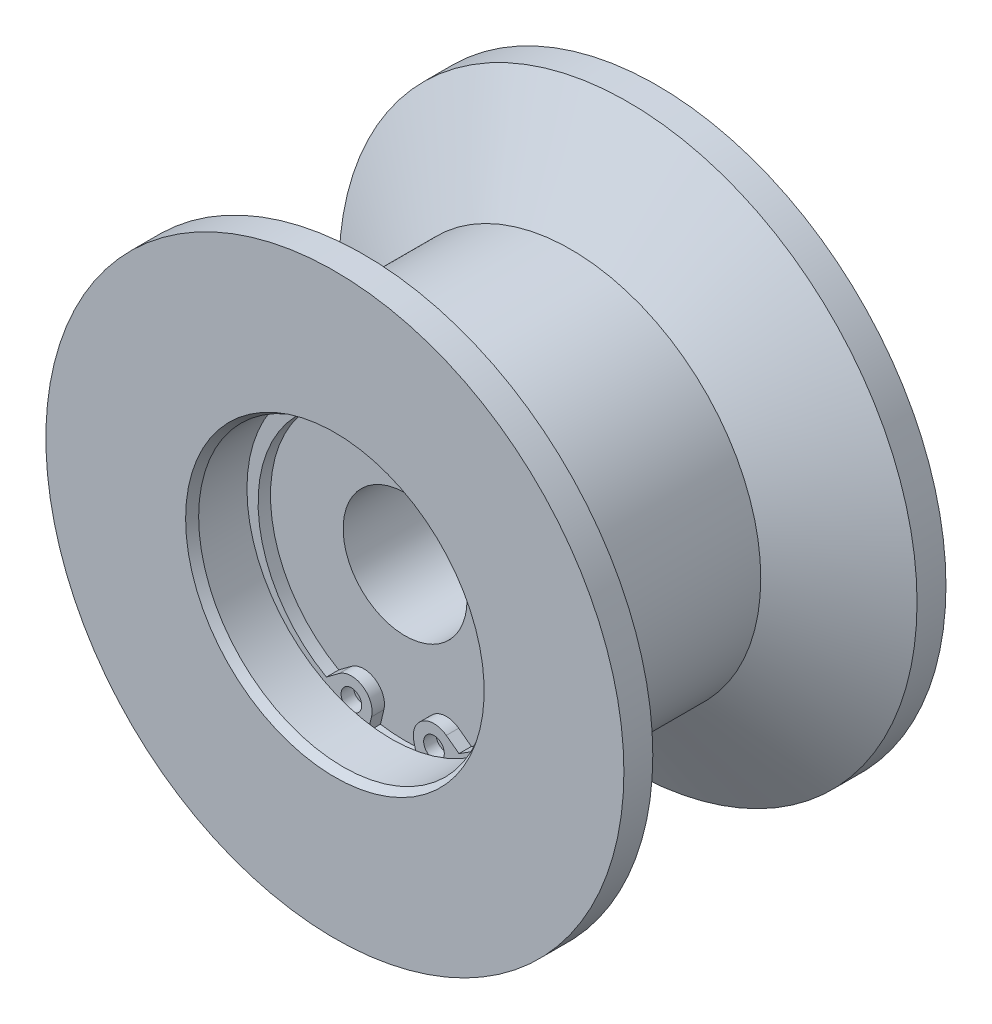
ISO-10303-21;
HEADER;
FILE_DESCRIPTION(('STEP AP214'),'2;1');
FILE_NAME('part.step','',(''),(''),'','','');
FILE_SCHEMA(('AUTOMOTIVE_DESIGN { 1 0 10303 214 1 1 1 1 }'));
ENDSEC;
DATA;
#1=APPLICATION_CONTEXT('core data for automotive mechanical design processes');
#2=APPLICATION_PROTOCOL_DEFINITION('international standard','automotive_design',2000,#1);
#3=PRODUCT_CONTEXT('',#1,'mechanical');
#4=PRODUCT('Part','Part','',(#3));
#5=PRODUCT_RELATED_PRODUCT_CATEGORY('part','',(#4));
#6=PRODUCT_DEFINITION_FORMATION('','',#4);
#7=PRODUCT_DEFINITION_CONTEXT('part definition',#1,'design');
#8=PRODUCT_DEFINITION('design','',#6,#7);
#9=PRODUCT_DEFINITION_SHAPE('','',#8);
#10=(LENGTH_UNIT() NAMED_UNIT(*) SI_UNIT(.MILLI.,.METRE.));
#11=(NAMED_UNIT(*) PLANE_ANGLE_UNIT() SI_UNIT($,.RADIAN.));
#12=(NAMED_UNIT(*) SI_UNIT($,.STERADIAN.) SOLID_ANGLE_UNIT());
#13=UNCERTAINTY_MEASURE_WITH_UNIT(LENGTH_MEASURE(1.E-05),#10,'distance_accuracy_value','');
#14=(GEOMETRIC_REPRESENTATION_CONTEXT(3) GLOBAL_UNCERTAINTY_ASSIGNED_CONTEXT((#13)) GLOBAL_UNIT_ASSIGNED_CONTEXT((#10,
#11,#12)) REPRESENTATION_CONTEXT('',''));
#15=CARTESIAN_POINT('',(0.,0.,0.));
#16=DIRECTION('',(0.,0.,1.));
#17=DIRECTION('',(1.,0.,0.));
#18=AXIS2_PLACEMENT_3D('',#15,#16,#17);
#19=CARTESIAN_POINT('',(6.49138441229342,-13.9421779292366,12.6));
#20=DIRECTION('',(-0.596553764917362,-0.802573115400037,0.));
#21=DIRECTION('',(-0.802573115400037,0.596553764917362,0.));
#22=AXIS2_PLACEMENT_3D('',#19,#20,#21);
#23=PLANE('',#22);
#24=DIRECTION('',(-0.802573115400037,0.596553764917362,0.));
#25=VECTOR('',#24,1.);
#26=CARTESIAN_POINT('',(6.49138441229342,-13.9421779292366,12.5));
#27=LINE('',#26,#25);
#28=CARTESIAN_POINT('',(8.02922574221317,-15.0852576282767,12.5));
#29=VERTEX_POINT('',#28);
#30=CARTESIAN_POINT('',(6.49138441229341,-13.9421779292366,12.5));
#31=VERTEX_POINT('',#30);
#32=EDGE_CURVE('E307',#29,#31,#27,.T.);
#33=ORIENTED_EDGE('',*,*,#32,.F.);
#34=DIRECTION('',(0.,0.,-1.));
#35=VECTOR('',#34,1.);
#36=CARTESIAN_POINT('',(8.02922574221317,-15.0852576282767,12.6));
#37=LINE('',#36,#35);
#38=CARTESIAN_POINT('',(8.02922574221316,-15.0852576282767,11.));
#39=VERTEX_POINT('',#38);
#40=EDGE_CURVE('E157',#29,#39,#37,.T.);
#41=ORIENTED_EDGE('',*,*,#40,.T.);
#42=DIRECTION('',(-0.802573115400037,0.596553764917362,0.));
#43=VECTOR('',#42,1.);
#44=CARTESIAN_POINT('',(-7.95591287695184,-3.20348082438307,11.));
#45=LINE('',#44,#43);
#46=CARTESIAN_POINT('',(6.49138441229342,-13.9421779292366,11.));
#47=VERTEX_POINT('',#46);
#48=EDGE_CURVE('E144',#39,#47,#45,.T.);
#49=ORIENTED_EDGE('',*,*,#48,.T.);
#50=DIRECTION('',(0.,0.,-1.));
#51=VECTOR('',#50,1.);
#52=CARTESIAN_POINT('',(6.49138441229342,-13.9421779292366,12.6));
#53=LINE('',#52,#51);
#54=EDGE_CURVE('E154',#31,#47,#53,.T.);
#55=ORIENTED_EDGE('',*,*,#54,.F.);
#56=EDGE_LOOP('',(#33,#41,#49,#55));
#57=FACE_BOUND('',#56,.T.);
#58=ADVANCED_FACE('F14',(#57),#23,.F.);
#59=CARTESIAN_POINT('',(0.,-0.9,12.6));
#60=DIRECTION('',(0.,0.,1.));
#61=DIRECTION('',(-1.,0.,0.));
#62=AXIS2_PLACEMENT_3D('',#59,#60,#61);
#63=CYLINDRICAL_SURFACE('',#62,16.3);
#64=CARTESIAN_POINT('',(0.,-0.9,12.5));
#65=DIRECTION('',(0.,0.,1.));
#66=DIRECTION('',(1.,0.,0.));
#67=AXIS2_PLACEMENT_3D('',#64,#65,#66);
#68=CIRCLE('',#67,16.3);
#69=CARTESIAN_POINT('',(-8.02922574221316,-15.0852576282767,12.5));
#70=VERTEX_POINT('',#69);
#71=EDGE_CURVE('E298',#70,#29,#68,.F.);
#72=ORIENTED_EDGE('',*,*,#71,.F.);
#73=DIRECTION('',(0.,0.,-1.));
#74=VECTOR('',#73,1.);
#75=CARTESIAN_POINT('',(-8.02922574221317,-15.0852576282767,12.6));
#76=LINE('',#75,#74);
#77=CARTESIAN_POINT('',(-8.02922574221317,-15.0852576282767,11.));
#78=VERTEX_POINT('',#77);
#79=EDGE_CURVE('E160',#70,#78,#76,.T.);
#80=ORIENTED_EDGE('',*,*,#79,.T.);
#81=CARTESIAN_POINT('',(0.,-0.9,11.));
#82=DIRECTION('',(0.,0.,-1.));
#83=DIRECTION('',(-1.,0.,0.));
#84=AXIS2_PLACEMENT_3D('',#81,#82,#83);
#85=CIRCLE('',#84,16.3);
#86=EDGE_CURVE('E140',#78,#39,#85,.T.);
#87=ORIENTED_EDGE('',*,*,#86,.T.);
#88=ORIENTED_EDGE('',*,*,#40,.F.);
#89=EDGE_LOOP('',(#72,#80,#87,#88));
#90=FACE_BOUND('',#89,.T.);
#91=ADVANCED_FACE('F239',(#90),#63,.F.);
#92=CARTESIAN_POINT('',(-6.49138441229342,-13.9421779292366,12.6));
#93=DIRECTION('',(0.596553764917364,-0.802573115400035,0.));
#94=DIRECTION('',(0.,0.,-1.));
#95=AXIS2_PLACEMENT_3D('',#92,#93,#94);
#96=PLANE('',#95);
#97=DIRECTION('',(-0.802573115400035,-0.596553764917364,0.));
#98=VECTOR('',#97,1.);
#99=CARTESIAN_POINT('',(-6.49138441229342,-13.9421779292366,12.5));
#100=LINE('',#99,#98);
#101=CARTESIAN_POINT('',(-6.49138441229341,-13.9421779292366,12.5));
#102=VERTEX_POINT('',#101);
#103=EDGE_CURVE('E301',#102,#70,#100,.T.);
#104=ORIENTED_EDGE('',*,*,#103,.F.);
#105=DIRECTION('',(0.,0.,-1.));
#106=VECTOR('',#105,1.);
#107=CARTESIAN_POINT('',(-6.49138441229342,-13.9421779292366,12.6));
#108=LINE('',#107,#106);
#109=CARTESIAN_POINT('',(-6.49138441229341,-13.9421779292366,11.));
#110=VERTEX_POINT('',#109);
#111=EDGE_CURVE('E163',#102,#110,#108,.T.);
#112=ORIENTED_EDGE('',*,*,#111,.T.);
#113=DIRECTION('',(-0.802573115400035,-0.596553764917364,0.));
#114=VECTOR('',#113,1.);
#115=CARTESIAN_POINT('',(7.95591287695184,-3.203480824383,11.));
#116=LINE('',#115,#114);
#117=EDGE_CURVE('E136',#110,#78,#116,.T.);
#118=ORIENTED_EDGE('',*,*,#117,.T.);
#119=ORIENTED_EDGE('',*,*,#79,.F.);
#120=EDGE_LOOP('',(#104,#112,#118,#119));
#121=FACE_BOUND('',#120,.T.);
#122=ADVANCED_FACE('F245',(#121),#96,.F.);
#123=CARTESIAN_POINT('',(5.,-15.9486107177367,12.6));
#124=DIRECTION('',(0.,0.,1.));
#125=DIRECTION('',(-1.,0.,0.));
#126=AXIS2_PLACEMENT_3D('',#123,#124,#125);
#127=CYLINDRICAL_SURFACE('',#126,2.5);
#128=DIRECTION('',(0.,0.,-1.));
#129=VECTOR('',#128,1.);
#130=CARTESIAN_POINT('',(2.5678231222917,-16.526983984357,12.6));
#131=LINE('',#130,#129);
#132=CARTESIAN_POINT('',(2.5678231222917,-16.526983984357,12.5));
#133=VERTEX_POINT('',#132);
#134=CARTESIAN_POINT('',(2.56782312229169,-16.526983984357,11.));
#135=VERTEX_POINT('',#134);
#136=EDGE_CURVE('E41',#133,#135,#131,.T.);
#137=ORIENTED_EDGE('',*,*,#136,.F.);
#138=CARTESIAN_POINT('',(5.,-15.9486107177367,12.5));
#139=DIRECTION('',(0.,0.,1.));
#140=DIRECTION('',(1.,0.,0.));
#141=AXIS2_PLACEMENT_3D('',#138,#139,#140);
#142=CIRCLE('',#141,2.5);
#143=EDGE_CURVE('E29',#133,#31,#142,.F.);
#144=ORIENTED_EDGE('',*,*,#143,.T.);
#145=ORIENTED_EDGE('',*,*,#54,.T.);
#146=CARTESIAN_POINT('',(5.,-15.9486107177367,11.));
#147=DIRECTION('',(0.,0.,-1.));
#148=DIRECTION('',(-1.,0.,0.));
#149=AXIS2_PLACEMENT_3D('',#146,#147,#148);
#150=CIRCLE('',#149,2.5);
#151=EDGE_CURVE('E148',#135,#47,#150,.T.);
#152=ORIENTED_EDGE('',*,*,#151,.F.);
#153=EDGE_LOOP('',(#137,#144,#145,#152));
#154=FACE_BOUND('',#153,.T.);
#155=ADVANCED_FACE('F291',(#154),#127,.T.);
#156=CARTESIAN_POINT('',(-5.,-15.9486107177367,12.6));
#157=DIRECTION('',(0.,0.,1.));
#158=DIRECTION('',(-1.,0.,0.));
#159=AXIS2_PLACEMENT_3D('',#156,#157,#158);
#160=CYLINDRICAL_SURFACE('',#159,2.5);
#161=ORIENTED_EDGE('',*,*,#111,.F.);
#162=CARTESIAN_POINT('',(-5.,-15.9486107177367,12.5));
#163=DIRECTION('',(0.,0.,1.));
#164=DIRECTION('',(1.,0.,0.));
#165=AXIS2_PLACEMENT_3D('',#162,#163,#164);
#166=CIRCLE('',#165,2.5);
#167=CARTESIAN_POINT('',(-2.5678231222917,-16.526983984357,12.5));
#168=VERTEX_POINT('',#167);
#169=EDGE_CURVE('E107',#102,#168,#166,.F.);
#170=ORIENTED_EDGE('',*,*,#169,.T.);
#171=DIRECTION('',(0.,0.,-1.));
#172=VECTOR('',#171,1.);
#173=CARTESIAN_POINT('',(-2.56782312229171,-16.526983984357,12.6));
#174=LINE('',#173,#172);
#175=CARTESIAN_POINT('',(-2.5678231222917,-16.526983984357,11.));
#176=VERTEX_POINT('',#175);
#177=EDGE_CURVE('E105',#168,#176,#174,.T.);
#178=ORIENTED_EDGE('',*,*,#177,.T.);
#179=CARTESIAN_POINT('',(-5.,-15.9486107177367,11.));
#180=DIRECTION('',(0.,0.,-1.));
#181=DIRECTION('',(-1.,0.,0.));
#182=AXIS2_PLACEMENT_3D('',#179,#180,#181);
#183=CIRCLE('',#182,2.5);
#184=EDGE_CURVE('E130',#110,#176,#183,.T.);
#185=ORIENTED_EDGE('',*,*,#184,.F.);
#186=EDGE_LOOP('',(#161,#170,#178,#185));
#187=FACE_BOUND('',#186,.T.);
#188=ADVANCED_FACE('F16',(#187),#160,.T.);
#189=CARTESIAN_POINT('',(-2.56782312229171,-16.526983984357,12.6));
#190=DIRECTION('',(-0.97287075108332,0.231349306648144,0.));
#191=DIRECTION('',(0.,0.,1.));
#192=AXIS2_PLACEMENT_3D('',#189,#190,#191);
#193=PLANE('',#192);
#194=DIRECTION('',(0.231349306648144,0.97287075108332,0.));
#195=VECTOR('',#194,1.);
#196=CARTESIAN_POINT('',(-2.56782312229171,-16.526983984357,12.5));
#197=LINE('',#196,#195);
#198=CARTESIAN_POINT('',(-2.97957431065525,-18.2584812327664,12.5));
#199=VERTEX_POINT('',#198);
#200=EDGE_CURVE('E92',#199,#168,#197,.T.);
#201=ORIENTED_EDGE('',*,*,#200,.F.);
#202=DIRECTION('',(0.,0.,-1.));
#203=VECTOR('',#202,1.);
#204=CARTESIAN_POINT('',(-2.97957431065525,-18.2584812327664,12.65));
#205=LINE('',#204,#203);
#206=CARTESIAN_POINT('',(-2.97957431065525,-18.2584812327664,11.));
#207=VERTEX_POINT('',#206);
#208=EDGE_CURVE('E103',#207,#199,#205,.F.);
#209=ORIENTED_EDGE('',*,*,#208,.F.);
#210=DIRECTION('',(0.231349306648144,0.97287075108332,0.));
#211=VECTOR('',#210,1.);
#212=CARTESIAN_POINT('',(2.97743793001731,6.79196329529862,11.));
#213=LINE('',#212,#211);
#214=EDGE_CURVE('E134',#207,#176,#213,.T.);
#215=ORIENTED_EDGE('',*,*,#214,.T.);
#216=ORIENTED_EDGE('',*,*,#177,.F.);
#217=EDGE_LOOP('',(#201,#209,#215,#216));
#218=FACE_BOUND('',#217,.T.);
#219=ADVANCED_FACE('F101',(#218),#193,.F.);
#220=CARTESIAN_POINT('',(2.5678231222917,-16.526983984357,12.6));
#221=DIRECTION('',(0.972870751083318,0.231349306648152,0.));
#222=DIRECTION('',(0.,0.,-1.));
#223=AXIS2_PLACEMENT_3D('',#220,#221,#222);
#224=PLANE('',#223);
#225=DIRECTION('',(0.231349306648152,-0.972870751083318,0.));
#226=VECTOR('',#225,1.);
#227=CARTESIAN_POINT('',(2.5678231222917,-16.526983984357,12.5));
#228=LINE('',#227,#226);
#229=CARTESIAN_POINT('',(2.97957431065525,-18.2584812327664,12.5));
#230=VERTEX_POINT('',#229);
#231=EDGE_CURVE('E22',#133,#230,#228,.T.);
#232=ORIENTED_EDGE('',*,*,#231,.F.);
#233=ORIENTED_EDGE('',*,*,#136,.T.);
#234=DIRECTION('',(0.231349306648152,-0.972870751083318,0.));
#235=VECTOR('',#234,1.);
#236=CARTESIAN_POINT('',(-2.97743793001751,6.79196329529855,11.));
#237=LINE('',#236,#235);
#238=CARTESIAN_POINT('',(2.97957431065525,-18.2584812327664,11.));
#239=VERTEX_POINT('',#238);
#240=EDGE_CURVE('E152',#135,#239,#237,.T.);
#241=ORIENTED_EDGE('',*,*,#240,.T.);
#242=DIRECTION('',(0.,0.,-1.));
#243=VECTOR('',#242,1.);
#244=CARTESIAN_POINT('',(2.97957431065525,-18.2584812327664,12.65));
#245=LINE('',#244,#243);
#246=EDGE_CURVE('E113',#230,#239,#245,.T.);
#247=ORIENTED_EDGE('',*,*,#246,.F.);
#248=EDGE_LOOP('',(#232,#233,#241,#247));
#249=FACE_BOUND('',#248,.T.);
#250=ADVANCED_FACE('F315',(#249),#224,.F.);
#251=CARTESIAN_POINT('',(0.,0.,24.5));
#252=DIRECTION('',(0.,0.,1.));
#253=DIRECTION('',(1.,0.,0.));
#254=AXIS2_PLACEMENT_3D('',#251,#252,#253);
#255=CYLINDRICAL_SURFACE('',#254,17.5);
#256=CARTESIAN_POINT('',(0.,0.,18.5));
#257=DIRECTION('',(0.,0.,-1.));
#258=DIRECTION('',(-1.,0.,0.));
#259=AXIS2_PLACEMENT_3D('',#256,#257,#258);
#260=CIRCLE('',#259,17.5);
#261=CARTESIAN_POINT('',(-17.5,0.,18.5));
#262=VERTEX_POINT('',#261);
#263=EDGE_CURVE('E119',#262,#262,#260,.F.);
#264=ORIENTED_EDGE('',*,*,#263,.T.);
#265=EDGE_LOOP('',(#264));
#266=FACE_BOUND('',#265,.T.);
#267=CARTESIAN_POINT('',(0.,0.,12.65));
#268=DIRECTION('',(0.,0.,-1.));
#269=DIRECTION('',(-1.,0.,0.));
#270=AXIS2_PLACEMENT_3D('',#267,#268,#269);
#271=CIRCLE('',#270,17.5);
#272=CARTESIAN_POINT('',(-17.5,0.,12.65));
#273=VERTEX_POINT('',#272);
#274=EDGE_CURVE('E97',#273,#273,#271,.T.);
#275=ORIENTED_EDGE('',*,*,#274,.T.);
#276=EDGE_LOOP('',(#275));
#277=FACE_BOUND('',#276,.T.);
#278=ADVANCED_FACE('F215',(#266,#277),#255,.F.);
#279=CARTESIAN_POINT('',(0.,0.,24.5));
#280=DIRECTION('',(0.,0.,1.));
#281=DIRECTION('',(1.,0.,0.));
#282=AXIS2_PLACEMENT_3D('',#279,#280,#281);
#283=CYLINDRICAL_SURFACE('',#282,22.9999999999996);
#284=CARTESIAN_POINT('',(0.,0.,9.0717967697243));
#285=DIRECTION('',(0.,0.,1.));
#286=DIRECTION('',(1.,0.,0.));
#287=AXIS2_PLACEMENT_3D('',#284,#285,#286);
#288=CIRCLE('',#287,22.9999999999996);
#289=CARTESIAN_POINT('',(22.9999999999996,0.,9.0717967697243));
#290=VERTEX_POINT('',#289);
#291=EDGE_CURVE('E186',#290,#290,#288,.T.);
#292=ORIENTED_EDGE('',*,*,#291,.F.);
#293=EDGE_LOOP('',(#292));
#294=FACE_BOUND('',#293,.T.);
#295=CARTESIAN_POINT('',(0.,0.,-9.07179676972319));
#296=DIRECTION('',(0.,0.,1.));
#297=DIRECTION('',(1.,0.,0.));
#298=AXIS2_PLACEMENT_3D('',#295,#296,#297);
#299=CIRCLE('',#298,22.9999999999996);
#300=CARTESIAN_POINT('',(22.9999999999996,0.,-9.07179676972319));
#301=VERTEX_POINT('',#300);
#302=EDGE_CURVE('E189',#301,#301,#299,.T.);
#303=ORIENTED_EDGE('',*,*,#302,.T.);
#304=EDGE_LOOP('',(#303));
#305=FACE_BOUND('',#304,.T.);
#306=ADVANCED_FACE('F314',(#294,#305),#283,.T.);
#307=CARTESIAN_POINT('',(0.,0.,-15.9999999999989));
#308=DIRECTION('',(0.,0.,-1.));
#309=DIRECTION('',(-1.,0.,0.));
#310=AXIS2_PLACEMENT_3D('',#307,#308,#309);
#311=CONICAL_SURFACE('',#310,35.,1.0471975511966);
#312=ORIENTED_EDGE('',*,*,#302,.F.);
#313=EDGE_LOOP('',(#312));
#314=FACE_BOUND('',#313,.T.);
#315=CARTESIAN_POINT('',(0.,0.,-15.9999999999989));
#316=DIRECTION('',(0.,0.,1.));
#317=DIRECTION('',(1.,0.,0.));
#318=AXIS2_PLACEMENT_3D('',#315,#316,#317);
#319=CIRCLE('',#318,35.);
#320=CARTESIAN_POINT('',(35.,0.,-15.9999999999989));
#321=VERTEX_POINT('',#320);
#322=EDGE_CURVE('E192',#321,#321,#319,.T.);
#323=ORIENTED_EDGE('',*,*,#322,.T.);
#324=EDGE_LOOP('',(#323));
#325=FACE_BOUND('',#324,.T.);
#326=ADVANCED_FACE('F320',(#314,#325),#311,.T.);
#327=CARTESIAN_POINT('',(0.,0.,9.0717967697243));
#328=DIRECTION('',(0.,0.,1.));
#329=DIRECTION('',(1.,0.,0.));
#330=AXIS2_PLACEMENT_3D('',#327,#328,#329);
#331=CONICAL_SURFACE('',#330,22.9999999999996,1.0471975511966);
#332=CARTESIAN_POINT('',(0.,0.,16.));
#333=DIRECTION('',(0.,0.,1.));
#334=DIRECTION('',(1.,0.,0.));
#335=AXIS2_PLACEMENT_3D('',#332,#333,#334);
#336=CIRCLE('',#335,35.);
#337=CARTESIAN_POINT('',(35.,0.,16.));
#338=VERTEX_POINT('',#337);
#339=EDGE_CURVE('E183',#338,#338,#336,.T.);
#340=ORIENTED_EDGE('',*,*,#339,.F.);
#341=EDGE_LOOP('',(#340));
#342=FACE_BOUND('',#341,.T.);
#343=ORIENTED_EDGE('',*,*,#291,.T.);
#344=EDGE_LOOP('',(#343));
#345=FACE_BOUND('',#344,.T.);
#346=ADVANCED_FACE('F338',(#342,#345),#331,.T.);
#347=CARTESIAN_POINT('',(0.,0.,24.5));
#348=DIRECTION('',(0.,0.,1.));
#349=DIRECTION('',(1.,0.,0.));
#350=AXIS2_PLACEMENT_3D('',#347,#348,#349);
#351=CYLINDRICAL_SURFACE('',#350,35.);
#352=ORIENTED_EDGE('',*,*,#322,.F.);
#353=EDGE_LOOP('',(#352));
#354=FACE_BOUND('',#353,.T.);
#355=CARTESIAN_POINT('',(0.,0.,-19.5000000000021));
#356=DIRECTION('',(0.,0.,1.));
#357=DIRECTION('',(1.,0.,0.));
#358=AXIS2_PLACEMENT_3D('',#355,#356,#357);
#359=CIRCLE('',#358,35.);
#360=CARTESIAN_POINT('',(35.,0.,-19.5000000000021));
#361=VERTEX_POINT('',#360);
#362=EDGE_CURVE('E195',#361,#361,#359,.T.);
#363=ORIENTED_EDGE('',*,*,#362,.T.);
#364=EDGE_LOOP('',(#363));
#365=FACE_BOUND('',#364,.T.);
#366=ADVANCED_FACE('F330',(#354,#365),#351,.T.);
#367=CARTESIAN_POINT('',(0.,0.,24.5));
#368=DIRECTION('',(0.,0.,1.));
#369=DIRECTION('',(1.,0.,0.));
#370=AXIS2_PLACEMENT_3D('',#367,#368,#369);
#371=CYLINDRICAL_SURFACE('',#370,35.);
#372=CARTESIAN_POINT('',(0.,0.,19.5));
#373=DIRECTION('',(0.,0.,1.));
#374=DIRECTION('',(1.,0.,0.));
#375=AXIS2_PLACEMENT_3D('',#372,#373,#374);
#376=CIRCLE('',#375,35.);
#377=CARTESIAN_POINT('',(35.,0.,19.5));
#378=VERTEX_POINT('',#377);
#379=EDGE_CURVE('E210',#378,#378,#376,.T.);
#380=ORIENTED_EDGE('',*,*,#379,.F.);
#381=EDGE_LOOP('',(#380));
#382=FACE_BOUND('',#381,.T.);
#383=ORIENTED_EDGE('',*,*,#339,.T.);
#384=EDGE_LOOP('',(#383));
#385=FACE_BOUND('',#384,.T.);
#386=ADVANCED_FACE('F328',(#382,#385),#371,.T.);
#387=CARTESIAN_POINT('',(0.,14.5,-19.5000000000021));
#388=DIRECTION('',(0.,0.,1.));
#389=DIRECTION('',(1.,0.,0.));
#390=AXIS2_PLACEMENT_3D('',#387,#388,#389);
#391=PLANE('',#390);
#392=ORIENTED_EDGE('',*,*,#362,.F.);
#393=EDGE_LOOP('',(#392));
#394=FACE_BOUND('',#393,.T.);
#395=CARTESIAN_POINT('',(0.,0.,-19.5000000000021));
#396=DIRECTION('',(0.,0.,1.));
#397=DIRECTION('',(1.,0.,0.));
#398=AXIS2_PLACEMENT_3D('',#395,#396,#397);
#399=CIRCLE('',#398,14.5);
#400=CARTESIAN_POINT('',(14.5,0.,-19.5000000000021));
#401=VERTEX_POINT('',#400);
#402=EDGE_CURVE('E198',#401,#401,#399,.T.);
#403=ORIENTED_EDGE('',*,*,#402,.T.);
#404=EDGE_LOOP('',(#403));
#405=FACE_BOUND('',#404,.T.);
#406=ADVANCED_FACE('F326',(#394,#405),#391,.F.);
#407=CARTESIAN_POINT('',(0.,17.5,19.5));
#408=DIRECTION('',(0.,0.,-1.));
#409=DIRECTION('',(-1.,0.,0.));
#410=AXIS2_PLACEMENT_3D('',#407,#408,#409);
#411=PLANE('',#410);
#412=CARTESIAN_POINT('',(0.,0.,19.5));
#413=DIRECTION('',(0.,0.,-1.));
#414=DIRECTION('',(-1.,0.,0.));
#415=AXIS2_PLACEMENT_3D('',#412,#413,#414);
#416=CIRCLE('',#415,18.0773502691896);
#417=CARTESIAN_POINT('',(-18.0773502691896,0.,19.5));
#418=VERTEX_POINT('',#417);
#419=EDGE_CURVE('E114',#418,#418,#416,.T.);
#420=ORIENTED_EDGE('',*,*,#419,.T.);
#421=EDGE_LOOP('',(#420));
#422=FACE_BOUND('',#421,.T.);
#423=ORIENTED_EDGE('',*,*,#379,.T.);
#424=EDGE_LOOP('',(#423));
#425=FACE_BOUND('',#424,.T.);
#426=ADVANCED_FACE('F232',(#422,#425),#411,.F.);
#427=CARTESIAN_POINT('',(0.,0.,24.5));
#428=DIRECTION('',(0.,0.,1.));
#429=DIRECTION('',(1.,0.,0.));
#430=AXIS2_PLACEMENT_3D('',#427,#428,#429);
#431=CYLINDRICAL_SURFACE('',#430,14.5);
#432=ORIENTED_EDGE('',*,*,#402,.F.);
#433=EDGE_LOOP('',(#432));
#434=FACE_BOUND('',#433,.T.);
#435=CARTESIAN_POINT('',(0.,0.,-11.0000000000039));
#436=DIRECTION('',(0.,0.,1.));
#437=DIRECTION('',(1.,0.,0.));
#438=AXIS2_PLACEMENT_3D('',#435,#436,#437);
#439=CIRCLE('',#438,14.5);
#440=CARTESIAN_POINT('',(14.5,0.,-11.0000000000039));
#441=VERTEX_POINT('',#440);
#442=EDGE_CURVE('E201',#441,#441,#439,.T.);
#443=ORIENTED_EDGE('',*,*,#442,.T.);
#444=EDGE_LOOP('',(#443));
#445=FACE_BOUND('',#444,.T.);
#446=ADVANCED_FACE('F221',(#434,#445),#431,.F.);
#447=CARTESIAN_POINT('',(0.,0.,18.5));
#448=DIRECTION('',(0.,0.,1.));
#449=DIRECTION('',(1.,0.,0.));
#450=AXIS2_PLACEMENT_3D('',#447,#448,#449);
#451=CONICAL_SURFACE('',#450,17.5,0.523598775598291);
#452=ORIENTED_EDGE('',*,*,#419,.F.);
#453=EDGE_LOOP('',(#452));
#454=FACE_BOUND('',#453,.T.);
#455=ORIENTED_EDGE('',*,*,#263,.F.);
#456=EDGE_LOOP('',(#455));
#457=FACE_BOUND('',#456,.T.);
#458=ADVANCED_FACE('F218',(#454,#457),#451,.F.);
#459=CARTESIAN_POINT('',(0.,7.5,-11.0000000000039));
#460=DIRECTION('',(0.,0.,1.));
#461=DIRECTION('',(1.,0.,0.));
#462=AXIS2_PLACEMENT_3D('',#459,#460,#461);
#463=PLANE('',#462);
#464=ORIENTED_EDGE('',*,*,#442,.F.);
#465=EDGE_LOOP('',(#464));
#466=FACE_BOUND('',#465,.T.);
#467=CARTESIAN_POINT('',(0.,0.,-11.0000000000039));
#468=DIRECTION('',(0.,0.,1.));
#469=DIRECTION('',(1.,0.,0.));
#470=AXIS2_PLACEMENT_3D('',#467,#468,#469);
#471=CIRCLE('',#470,7.5);
#472=CARTESIAN_POINT('',(7.5,0.,-11.0000000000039));
#473=VERTEX_POINT('',#472);
#474=EDGE_CURVE('E204',#473,#473,#471,.T.);
#475=ORIENTED_EDGE('',*,*,#474,.T.);
#476=EDGE_LOOP('',(#475));
#477=FACE_BOUND('',#476,.T.);
#478=ADVANCED_FACE('F220',(#466,#477),#463,.F.);
#479=CARTESIAN_POINT('',(0.,0.,24.5));
#480=DIRECTION('',(0.,0.,1.));
#481=DIRECTION('',(1.,0.,0.));
#482=AXIS2_PLACEMENT_3D('',#479,#480,#481);
#483=CYLINDRICAL_SURFACE('',#482,7.5);
#484=ORIENTED_EDGE('',*,*,#474,.F.);
#485=EDGE_LOOP('',(#484));
#486=FACE_BOUND('',#485,.T.);
#487=CARTESIAN_POINT('',(0.,0.,11.));
#488=DIRECTION('',(0.,0.,1.));
#489=DIRECTION('',(1.,0.,0.));
#490=AXIS2_PLACEMENT_3D('',#487,#488,#489);
#491=CIRCLE('',#490,7.5);
#492=CARTESIAN_POINT('',(7.5,0.,11.));
#493=VERTEX_POINT('',#492);
#494=EDGE_CURVE('E207',#493,#493,#491,.T.);
#495=ORIENTED_EDGE('',*,*,#494,.T.);
#496=EDGE_LOOP('',(#495));
#497=FACE_BOUND('',#496,.T.);
#498=ADVANCED_FACE('F229',(#486,#497),#483,.F.);
#499=CARTESIAN_POINT('',(0.,7.5,11.));
#500=DIRECTION('',(0.,0.,-1.));
#501=DIRECTION('',(-1.,0.,0.));
#502=AXIS2_PLACEMENT_3D('',#499,#500,#501);
#503=PLANE('',#502);
#504=ORIENTED_EDGE('',*,*,#494,.F.);
#505=EDGE_LOOP('',(#504));
#506=FACE_BOUND('',#505,.T.);
#507=ORIENTED_EDGE('',*,*,#240,.F.);
#508=ORIENTED_EDGE('',*,*,#151,.T.);
#509=ORIENTED_EDGE('',*,*,#48,.F.);
#510=ORIENTED_EDGE('',*,*,#86,.F.);
#511=ORIENTED_EDGE('',*,*,#117,.F.);
#512=ORIENTED_EDGE('',*,*,#184,.T.);
#513=ORIENTED_EDGE('',*,*,#214,.F.);
#514=CARTESIAN_POINT('',(0.,0.,11.));
#515=DIRECTION('',(0.,0.,1.));
#516=DIRECTION('',(1.,0.,0.));
#517=AXIS2_PLACEMENT_3D('',#514,#515,#516);
#518=CIRCLE('',#517,18.5);
#519=EDGE_CURVE('E112',#207,#239,#518,.T.);
#520=ORIENTED_EDGE('',*,*,#519,.T.);
#521=EDGE_LOOP('',(#507,#508,#509,#510,#511,#512,#513,#520));
#522=FACE_BOUND('',#521,.T.);
#523=ADVANCED_FACE('F266',(#506,#522),#503,.F.);
#524=CARTESIAN_POINT('',(0.,0.,12.65));
#525=DIRECTION('',(0.,0.,-1.));
#526=DIRECTION('',(-1.,0.,0.));
#527=AXIS2_PLACEMENT_3D('',#524,#525,#526);
#528=CYLINDRICAL_SURFACE('',#527,18.5);
#529=CARTESIAN_POINT('',(0.,0.,12.65));
#530=DIRECTION('',(0.,0.,-1.));
#531=DIRECTION('',(-1.,0.,0.));
#532=AXIS2_PLACEMENT_3D('',#529,#530,#531);
#533=CIRCLE('',#532,18.5);
#534=CARTESIAN_POINT('',(-18.5,0.,12.65));
#535=VERTEX_POINT('',#534);
#536=EDGE_CURVE('E9',#535,#535,#533,.T.);
#537=ORIENTED_EDGE('',*,*,#536,.F.);
#538=EDGE_LOOP('',(#537));
#539=FACE_BOUND('',#538,.T.);
#540=CARTESIAN_POINT('',(0.,0.,12.5));
#541=DIRECTION('',(0.,0.,1.));
#542=DIRECTION('',(1.,0.,0.));
#543=AXIS2_PLACEMENT_3D('',#540,#541,#542);
#544=CIRCLE('',#543,18.5);
#545=EDGE_CURVE('E88',#230,#199,#544,.T.);
#546=ORIENTED_EDGE('',*,*,#545,.F.);
#547=ORIENTED_EDGE('',*,*,#246,.T.);
#548=ORIENTED_EDGE('',*,*,#519,.F.);
#549=ORIENTED_EDGE('',*,*,#208,.T.);
#550=EDGE_LOOP('',(#546,#547,#548,#549));
#551=FACE_BOUND('',#550,.T.);
#552=ADVANCED_FACE('F110',(#539,#551),#528,.F.);
#553=CARTESIAN_POINT('',(0.,0.,12.5));
#554=DIRECTION('',(0.,0.,1.));
#555=DIRECTION('',(1.,0.,0.));
#556=AXIS2_PLACEMENT_3D('',#553,#554,#555);
#557=PLANE('',#556);
#558=ORIENTED_EDGE('',*,*,#200,.T.);
#559=ORIENTED_EDGE('',*,*,#169,.F.);
#560=ORIENTED_EDGE('',*,*,#103,.T.);
#561=ORIENTED_EDGE('',*,*,#71,.T.);
#562=ORIENTED_EDGE('',*,*,#32,.T.);
#563=ORIENTED_EDGE('',*,*,#143,.F.);
#564=ORIENTED_EDGE('',*,*,#231,.T.);
#565=ORIENTED_EDGE('',*,*,#545,.T.);
#566=EDGE_LOOP('',(#558,#559,#560,#561,#562,#563,#564,#565));
#567=FACE_BOUND('',#566,.T.);
#568=CARTESIAN_POINT('',(5.,-15.9486107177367,12.5));
#569=DIRECTION('',(0.,0.,1.));
#570=DIRECTION('',(1.,0.,0.));
#571=AXIS2_PLACEMENT_3D('',#568,#569,#570);
#572=CIRCLE('',#571,1.25);
#573=CARTESIAN_POINT('',(6.25,-15.9486107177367,12.5));
#574=VERTEX_POINT('',#573);
#575=EDGE_CURVE('E106',#574,#574,#572,.F.);
#576=ORIENTED_EDGE('',*,*,#575,.T.);
#577=EDGE_LOOP('',(#576));
#578=FACE_BOUND('',#577,.T.);
#579=CARTESIAN_POINT('',(-5.,-15.9486107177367,12.5));
#580=DIRECTION('',(0.,0.,1.));
#581=DIRECTION('',(1.,0.,0.));
#582=AXIS2_PLACEMENT_3D('',#579,#580,#581);
#583=CIRCLE('',#582,1.25);
#584=CARTESIAN_POINT('',(-3.75,-15.9486107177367,12.5));
#585=VERTEX_POINT('',#584);
#586=EDGE_CURVE('E169',#585,#585,#583,.F.);
#587=ORIENTED_EDGE('',*,*,#586,.T.);
#588=EDGE_LOOP('',(#587));
#589=FACE_BOUND('',#588,.T.);
#590=ADVANCED_FACE('F90',(#567,#578,#589),#557,.T.);
#591=CARTESIAN_POINT('',(5.,-15.9486107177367,11.));
#592=DIRECTION('',(0.,0.,-1.));
#593=DIRECTION('',(-1.,0.,0.));
#594=AXIS2_PLACEMENT_3D('',#591,#592,#593);
#595=CIRCLE('',#594,1.25);
#596=CARTESIAN_POINT('',(3.75,-15.9486107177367,11.));
#597=VERTEX_POINT('',#596);
#598=EDGE_CURVE('E116',#597,#597,#595,.T.);
#599=ORIENTED_EDGE('',*,*,#598,.F.);
#600=EDGE_LOOP('',(#599));
#601=FACE_BOUND('',#600,.T.);
#602=ADVANCED_FACE('F265',(#601),#503,.F.);
#603=CARTESIAN_POINT('',(5.,-15.9486107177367,12.6));
#604=DIRECTION('',(0.,0.,1.));
#605=DIRECTION('',(-1.,0.,0.));
#606=AXIS2_PLACEMENT_3D('',#603,#604,#605);
#607=CYLINDRICAL_SURFACE('',#606,1.25);
#608=ORIENTED_EDGE('',*,*,#598,.T.);
#609=EDGE_LOOP('',(#608));
#610=FACE_BOUND('',#609,.T.);
#611=ORIENTED_EDGE('',*,*,#575,.F.);
#612=EDGE_LOOP('',(#611));
#613=FACE_BOUND('',#612,.T.);
#614=ADVANCED_FACE('F262',(#610,#613),#607,.F.);
#615=CARTESIAN_POINT('',(-5.,-15.9486107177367,11.));
#616=DIRECTION('',(0.,0.,-1.));
#617=DIRECTION('',(-1.,0.,0.));
#618=AXIS2_PLACEMENT_3D('',#615,#616,#617);
#619=CIRCLE('',#618,1.25);
#620=CARTESIAN_POINT('',(-6.25,-15.9486107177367,11.));
#621=VERTEX_POINT('',#620);
#622=EDGE_CURVE('E126',#621,#621,#619,.T.);
#623=ORIENTED_EDGE('',*,*,#622,.F.);
#624=EDGE_LOOP('',(#623));
#625=FACE_BOUND('',#624,.T.);
#626=ADVANCED_FACE('F254',(#625),#503,.F.);
#627=CARTESIAN_POINT('',(-5.,-15.9486107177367,12.6));
#628=DIRECTION('',(0.,0.,1.));
#629=DIRECTION('',(-1.,0.,0.));
#630=AXIS2_PLACEMENT_3D('',#627,#628,#629);
#631=CYLINDRICAL_SURFACE('',#630,1.25);
#632=ORIENTED_EDGE('',*,*,#622,.T.);
#633=EDGE_LOOP('',(#632));
#634=FACE_BOUND('',#633,.T.);
#635=ORIENTED_EDGE('',*,*,#586,.F.);
#636=EDGE_LOOP('',(#635));
#637=FACE_BOUND('',#636,.T.);
#638=ADVANCED_FACE('F251',(#634,#637),#631,.F.);
#639=CARTESIAN_POINT('',(0.,0.,12.65));
#640=DIRECTION('',(0.,0.,-1.));
#641=DIRECTION('',(-1.,0.,0.));
#642=AXIS2_PLACEMENT_3D('',#639,#640,#641);
#643=PLANE('',#642);
#644=ORIENTED_EDGE('',*,*,#536,.T.);
#645=EDGE_LOOP('',(#644));
#646=FACE_BOUND('',#645,.T.);
#647=ORIENTED_EDGE('',*,*,#274,.F.);
#648=EDGE_LOOP('',(#647));
#649=FACE_BOUND('',#648,.T.);
#650=ADVANCED_FACE('F253',(#646,#649),#643,.T.);
#651=CLOSED_SHELL('',(#58,#91,#122,#155,#188,#219,#250,#278,#306,#326,#346,#366,#386,#406,#426,
#446,#458,#478,#498,#523,#552,#590,#602,#614,#626,#638,#650));
#652=MANIFOLD_SOLID_BREP('B1',#651);
#653=ADVANCED_BREP_SHAPE_REPRESENTATION('',(#18,#652),#14);
#654=SHAPE_DEFINITION_REPRESENTATION(#9,#653);
ENDSEC;
END-ISO-10303-21;
